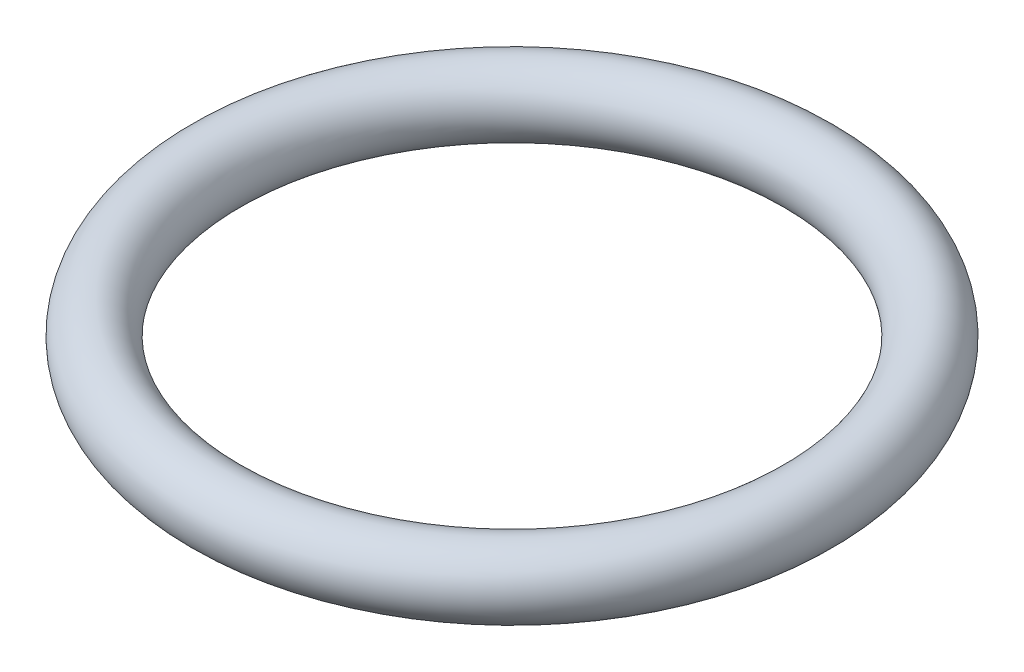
ISO-10303-21;
HEADER;
FILE_DESCRIPTION(('STEP AP214'),'2;1');
FILE_NAME('part.step','',(''),(''),'','','');
FILE_SCHEMA(('AUTOMOTIVE_DESIGN { 1 0 10303 214 1 1 1 1 }'));
ENDSEC;
DATA;
#1=APPLICATION_CONTEXT('core data for automotive mechanical design processes');
#2=APPLICATION_PROTOCOL_DEFINITION('international standard','automotive_design',2000,#1);
#3=PRODUCT_CONTEXT('',#1,'mechanical');
#4=PRODUCT('Part','Part','',(#3));
#5=PRODUCT_RELATED_PRODUCT_CATEGORY('part','',(#4));
#6=PRODUCT_DEFINITION_FORMATION('','',#4);
#7=PRODUCT_DEFINITION_CONTEXT('part definition',#1,'design');
#8=PRODUCT_DEFINITION('design','',#6,#7);
#9=PRODUCT_DEFINITION_SHAPE('','',#8);
#10=(LENGTH_UNIT() NAMED_UNIT(*) SI_UNIT(.MILLI.,.METRE.));
#11=(NAMED_UNIT(*) PLANE_ANGLE_UNIT() SI_UNIT($,.RADIAN.));
#12=(NAMED_UNIT(*) SI_UNIT($,.STERADIAN.) SOLID_ANGLE_UNIT());
#13=UNCERTAINTY_MEASURE_WITH_UNIT(LENGTH_MEASURE(1.E-05),#10,'distance_accuracy_value','');
#14=(GEOMETRIC_REPRESENTATION_CONTEXT(3) GLOBAL_UNCERTAINTY_ASSIGNED_CONTEXT((#13)) GLOBAL_UNIT_ASSIGNED_CONTEXT((#10,
#11,#12)) REPRESENTATION_CONTEXT('',''));
#15=CARTESIAN_POINT('',(0.,0.,0.));
#16=DIRECTION('',(0.,0.,1.));
#17=DIRECTION('',(1.,0.,0.));
#18=AXIS2_PLACEMENT_3D('',#15,#16,#17);
#19=CARTESIAN_POINT('',(0.,1.3,0.));
#20=DIRECTION('',(0.,1.,0.));
#21=DIRECTION('',(0.,0.,1.));
#22=AXIS2_PLACEMENT_3D('',#19,#20,#21);
#23=TOROIDAL_SURFACE('',#22,5.65,0.65);
#24=CARTESIAN_POINT('',(0.,1.3,6.3));
#25=VERTEX_POINT('',#24);
#26=VERTEX_LOOP('',#25);
#27=FACE_BOUND('',#26,.T.);
#28=ADVANCED_FACE('F24',(#27),#23,.T.);
#29=CLOSED_SHELL('',(#28));
#30=MANIFOLD_SOLID_BREP('B2',#29);
#31=ADVANCED_BREP_SHAPE_REPRESENTATION('',(#18,#30),#14);
#32=SHAPE_DEFINITION_REPRESENTATION(#9,#31);
ENDSEC;
END-ISO-10303-21;
